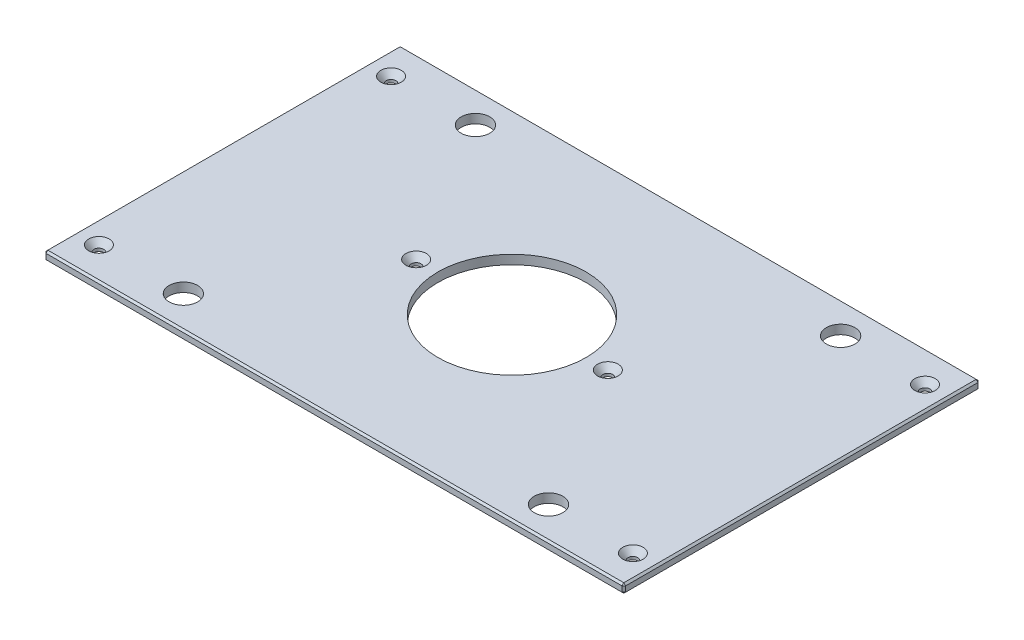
ISO-10303-21;
HEADER;
FILE_DESCRIPTION(('STEP AP214'),'2;1');
FILE_NAME('part.step','',(''),(''),'','','');
FILE_SCHEMA(('AUTOMOTIVE_DESIGN { 1 0 10303 214 1 1 1 1 }'));
ENDSEC;
DATA;
#1=APPLICATION_CONTEXT('core data for automotive mechanical design processes');
#2=APPLICATION_PROTOCOL_DEFINITION('international standard','automotive_design',2000,#1);
#3=PRODUCT_CONTEXT('',#1,'mechanical');
#4=PRODUCT('Part','Part','',(#3));
#5=PRODUCT_RELATED_PRODUCT_CATEGORY('part','',(#4));
#6=PRODUCT_DEFINITION_FORMATION('','',#4);
#7=PRODUCT_DEFINITION_CONTEXT('part definition',#1,'design');
#8=PRODUCT_DEFINITION('design','',#6,#7);
#9=PRODUCT_DEFINITION_SHAPE('','',#8);
#10=(LENGTH_UNIT() NAMED_UNIT(*) SI_UNIT(.MILLI.,.METRE.));
#11=(NAMED_UNIT(*) PLANE_ANGLE_UNIT() SI_UNIT($,.RADIAN.));
#12=(NAMED_UNIT(*) SI_UNIT($,.STERADIAN.) SOLID_ANGLE_UNIT());
#13=UNCERTAINTY_MEASURE_WITH_UNIT(LENGTH_MEASURE(1.E-05),#10,'distance_accuracy_value','');
#14=(GEOMETRIC_REPRESENTATION_CONTEXT(3) GLOBAL_UNCERTAINTY_ASSIGNED_CONTEXT((#13)) GLOBAL_UNIT_ASSIGNED_CONTEXT((#10,
#11,#12)) REPRESENTATION_CONTEXT('',''));
#15=CARTESIAN_POINT('',(0.,0.,0.));
#16=DIRECTION('',(0.,0.,1.));
#17=DIRECTION('',(1.,0.,0.));
#18=AXIS2_PLACEMENT_3D('',#15,#16,#17);
#19=CARTESIAN_POINT('',(-201.6125,6.35,-123.825));
#20=DIRECTION('',(1.,0.,0.));
#21=DIRECTION('',(0.,0.,-1.));
#22=AXIS2_PLACEMENT_3D('',#19,#20,#21);
#23=PLANE('',#22);
#24=DIRECTION('',(0.,0.,-1.));
#25=VECTOR('',#24,1.);
#26=CARTESIAN_POINT('',(-201.6125,5.08000000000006,-123.825));
#27=LINE('',#26,#25);
#28=CARTESIAN_POINT('',(-201.6125,5.08000000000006,122.555));
#29=VERTEX_POINT('',#28);
#30=CARTESIAN_POINT('',(-201.6125,5.08000000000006,-122.555));
#31=VERTEX_POINT('',#30);
#32=EDGE_CURVE('E136',#29,#31,#27,.T.);
#33=ORIENTED_EDGE('',*,*,#32,.T.);
#34=DIRECTION('',(0.,-1.,0.));
#35=VECTOR('',#34,1.);
#36=CARTESIAN_POINT('',(-201.6125,6.35,-122.555));
#37=LINE('',#36,#35);
#38=CARTESIAN_POINT('',(-201.6125,1.26999999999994,-122.555));
#39=VERTEX_POINT('',#38);
#40=EDGE_CURVE('E132',#31,#39,#37,.T.);
#41=ORIENTED_EDGE('',*,*,#40,.T.);
#42=DIRECTION('',(0.,0.,1.));
#43=VECTOR('',#42,1.);
#44=CARTESIAN_POINT('',(-201.6125,1.26999999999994,-123.825));
#45=LINE('',#44,#43);
#46=CARTESIAN_POINT('',(-201.6125,1.26999999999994,122.555));
#47=VERTEX_POINT('',#46);
#48=EDGE_CURVE('E127',#39,#47,#45,.T.);
#49=ORIENTED_EDGE('',*,*,#48,.T.);
#50=DIRECTION('',(0.,1.,0.));
#51=VECTOR('',#50,1.);
#52=CARTESIAN_POINT('',(-201.6125,6.35,122.555));
#53=LINE('',#52,#51);
#54=EDGE_CURVE('E129',#47,#29,#53,.T.);
#55=ORIENTED_EDGE('',*,*,#54,.T.);
#56=EDGE_LOOP('',(#33,#41,#49,#55));
#57=FACE_BOUND('',#56,.T.);
#58=ADVANCED_FACE('F36',(#57),#23,.F.);
#59=CARTESIAN_POINT('',(-201.6125,6.35,123.825));
#60=DIRECTION('',(0.,0.,-1.));
#61=DIRECTION('',(-1.,0.,0.));
#62=AXIS2_PLACEMENT_3D('',#59,#60,#61);
#63=PLANE('',#62);
#64=DIRECTION('',(1.,0.,0.));
#65=VECTOR('',#64,1.);
#66=CARTESIAN_POINT('',(-201.6125,1.26999999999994,123.825));
#67=LINE('',#66,#65);
#68=CARTESIAN_POINT('',(-200.3425,1.26999999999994,123.825));
#69=VERTEX_POINT('',#68);
#70=CARTESIAN_POINT('',(200.3425,1.26999999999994,123.825));
#71=VERTEX_POINT('',#70);
#72=EDGE_CURVE('E59',#69,#71,#67,.T.);
#73=ORIENTED_EDGE('',*,*,#72,.T.);
#74=DIRECTION('',(0.,1.,0.));
#75=VECTOR('',#74,1.);
#76=CARTESIAN_POINT('',(200.3425,6.35,123.825));
#77=LINE('',#76,#75);
#78=CARTESIAN_POINT('',(200.3425,5.08000000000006,123.825));
#79=VERTEX_POINT('',#78);
#80=EDGE_CURVE('E11',#71,#79,#77,.T.);
#81=ORIENTED_EDGE('',*,*,#80,.T.);
#82=DIRECTION('',(-1.,0.,0.));
#83=VECTOR('',#82,1.);
#84=CARTESIAN_POINT('',(-201.6125,5.08000000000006,123.825));
#85=LINE('',#84,#83);
#86=CARTESIAN_POINT('',(-200.3425,5.08000000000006,123.825));
#87=VERTEX_POINT('',#86);
#88=EDGE_CURVE('E45',#79,#87,#85,.T.);
#89=ORIENTED_EDGE('',*,*,#88,.T.);
#90=DIRECTION('',(0.,-1.,0.));
#91=VECTOR('',#90,1.);
#92=CARTESIAN_POINT('',(-200.3425,6.35,123.825));
#93=LINE('',#92,#91);
#94=EDGE_CURVE('E280',#87,#69,#93,.T.);
#95=ORIENTED_EDGE('',*,*,#94,.T.);
#96=EDGE_LOOP('',(#73,#81,#89,#95));
#97=FACE_BOUND('',#96,.T.);
#98=ADVANCED_FACE('F349',(#97),#63,.F.);
#99=CARTESIAN_POINT('',(201.6125,6.35,-123.825));
#100=DIRECTION('',(-1.,0.,0.));
#101=DIRECTION('',(0.,0.,1.));
#102=AXIS2_PLACEMENT_3D('',#99,#100,#101);
#103=PLANE('',#102);
#104=DIRECTION('',(0.,0.,-1.));
#105=VECTOR('',#104,1.);
#106=CARTESIAN_POINT('',(201.6125,1.26999999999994,-123.825));
#107=LINE('',#106,#105);
#108=CARTESIAN_POINT('',(201.6125,1.26999999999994,122.555));
#109=VERTEX_POINT('',#108);
#110=CARTESIAN_POINT('',(201.6125,1.26999999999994,-122.555));
#111=VERTEX_POINT('',#110);
#112=EDGE_CURVE('E275',#109,#111,#107,.T.);
#113=ORIENTED_EDGE('',*,*,#112,.T.);
#114=DIRECTION('',(0.,1.,0.));
#115=VECTOR('',#114,1.);
#116=CARTESIAN_POINT('',(201.6125,6.35,-122.555));
#117=LINE('',#116,#115);
#118=CARTESIAN_POINT('',(201.6125,5.08000000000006,-122.555));
#119=VERTEX_POINT('',#118);
#120=EDGE_CURVE('E277',#111,#119,#117,.T.);
#121=ORIENTED_EDGE('',*,*,#120,.T.);
#122=DIRECTION('',(0.,0.,1.));
#123=VECTOR('',#122,1.);
#124=CARTESIAN_POINT('',(201.6125,5.08000000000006,123.825));
#125=LINE('',#124,#123);
#126=CARTESIAN_POINT('',(201.6125,5.08000000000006,122.555));
#127=VERTEX_POINT('',#126);
#128=EDGE_CURVE('E273',#119,#127,#125,.T.);
#129=ORIENTED_EDGE('',*,*,#128,.T.);
#130=DIRECTION('',(0.,-1.,0.));
#131=VECTOR('',#130,1.);
#132=CARTESIAN_POINT('',(201.6125,6.35,122.555));
#133=LINE('',#132,#131);
#134=EDGE_CURVE('E271',#127,#109,#133,.T.);
#135=ORIENTED_EDGE('',*,*,#134,.T.);
#136=EDGE_LOOP('',(#113,#121,#129,#135));
#137=FACE_BOUND('',#136,.T.);
#138=ADVANCED_FACE('F336',(#137),#103,.F.);
#139=CARTESIAN_POINT('',(-201.6125,6.35,-123.825));
#140=DIRECTION('',(0.,0.,1.));
#141=DIRECTION('',(1.,0.,0.));
#142=AXIS2_PLACEMENT_3D('',#139,#140,#141);
#143=PLANE('',#142);
#144=DIRECTION('',(-1.,0.,0.));
#145=VECTOR('',#144,1.);
#146=CARTESIAN_POINT('',(-201.6125,1.26999999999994,-123.825));
#147=LINE('',#146,#145);
#148=CARTESIAN_POINT('',(200.3425,1.26999999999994,-123.825));
#149=VERTEX_POINT('',#148);
#150=CARTESIAN_POINT('',(-200.3425,1.26999999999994,-123.825));
#151=VERTEX_POINT('',#150);
#152=EDGE_CURVE('E247',#149,#151,#147,.T.);
#153=ORIENTED_EDGE('',*,*,#152,.T.);
#154=DIRECTION('',(0.,1.,0.));
#155=VECTOR('',#154,1.);
#156=CARTESIAN_POINT('',(-200.3425,6.35,-123.825));
#157=LINE('',#156,#155);
#158=CARTESIAN_POINT('',(-200.3425,5.08000000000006,-123.825));
#159=VERTEX_POINT('',#158);
#160=EDGE_CURVE('E251',#151,#159,#157,.T.);
#161=ORIENTED_EDGE('',*,*,#160,.T.);
#162=DIRECTION('',(1.,0.,0.));
#163=VECTOR('',#162,1.);
#164=CARTESIAN_POINT('',(201.6125,5.08000000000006,-123.825));
#165=LINE('',#164,#163);
#166=CARTESIAN_POINT('',(200.3425,5.08000000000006,-123.825));
#167=VERTEX_POINT('',#166);
#168=EDGE_CURVE('E249',#159,#167,#165,.T.);
#169=ORIENTED_EDGE('',*,*,#168,.T.);
#170=DIRECTION('',(0.,-1.,0.));
#171=VECTOR('',#170,1.);
#172=CARTESIAN_POINT('',(200.3425,6.35,-123.825));
#173=LINE('',#172,#171);
#174=EDGE_CURVE('E245',#167,#149,#173,.T.);
#175=ORIENTED_EDGE('',*,*,#174,.T.);
#176=EDGE_LOOP('',(#153,#161,#169,#175));
#177=FACE_BOUND('',#176,.T.);
#178=ADVANCED_FACE('F310',(#177),#143,.F.);
#179=CARTESIAN_POINT('',(0.,6.35,0.));
#180=DIRECTION('',(0.,1.,0.));
#181=DIRECTION('',(0.,0.,1.));
#182=AXIS2_PLACEMENT_3D('',#179,#180,#181);
#183=PLANE('',#182);
#184=CARTESIAN_POINT('',(185.7375,6.35,-101.6));
#185=DIRECTION('',(0.,1.,0.));
#186=DIRECTION('',(0.,0.,1.));
#187=AXIS2_PLACEMENT_3D('',#184,#185,#186);
#188=CIRCLE('',#187,7.13739999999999);
#189=CARTESIAN_POINT('',(185.7375,6.35,-94.4626));
#190=VERTEX_POINT('',#189);
#191=EDGE_CURVE('E753',#190,#190,#188,.T.);
#192=ORIENTED_EDGE('',*,*,#191,.F.);
#193=EDGE_LOOP('',(#192));
#194=FACE_BOUND('',#193,.T.);
#195=CARTESIAN_POINT('',(185.7375,6.35,101.6));
#196=DIRECTION('',(0.,1.,0.));
#197=DIRECTION('',(0.,0.,1.));
#198=AXIS2_PLACEMENT_3D('',#195,#196,#197);
#199=CIRCLE('',#198,7.13739999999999);
#200=CARTESIAN_POINT('',(185.7375,6.35,108.7374));
#201=VERTEX_POINT('',#200);
#202=EDGE_CURVE('E757',#201,#201,#199,.T.);
#203=ORIENTED_EDGE('',*,*,#202,.F.);
#204=EDGE_LOOP('',(#203));
#205=FACE_BOUND('',#204,.T.);
#206=CARTESIAN_POINT('',(-185.7375,6.35,101.6));
#207=DIRECTION('',(0.,1.,0.));
#208=DIRECTION('',(0.,0.,1.));
#209=AXIS2_PLACEMENT_3D('',#206,#207,#208);
#210=CIRCLE('',#209,7.13739999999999);
#211=CARTESIAN_POINT('',(-185.7375,6.35,108.7374));
#212=VERTEX_POINT('',#211);
#213=EDGE_CURVE('E761',#212,#212,#210,.T.);
#214=ORIENTED_EDGE('',*,*,#213,.F.);
#215=EDGE_LOOP('',(#214));
#216=FACE_BOUND('',#215,.T.);
#217=CARTESIAN_POINT('',(-66.675,6.35,0.));
#218=DIRECTION('',(0.,1.,0.));
#219=DIRECTION('',(0.,0.,1.));
#220=AXIS2_PLACEMENT_3D('',#217,#218,#219);
#221=CIRCLE('',#220,7.1374);
#222=CARTESIAN_POINT('',(-66.675,6.35,7.1374));
#223=VERTEX_POINT('',#222);
#224=EDGE_CURVE('E765',#223,#223,#221,.T.);
#225=ORIENTED_EDGE('',*,*,#224,.F.);
#226=EDGE_LOOP('',(#225));
#227=FACE_BOUND('',#226,.T.);
#228=CARTESIAN_POINT('',(66.675,6.35,0.));
#229=DIRECTION('',(0.,1.,0.));
#230=DIRECTION('',(0.,0.,1.));
#231=AXIS2_PLACEMENT_3D('',#228,#229,#230);
#232=CIRCLE('',#231,7.1374);
#233=CARTESIAN_POINT('',(66.675,6.35,7.1374));
#234=VERTEX_POINT('',#233);
#235=EDGE_CURVE('E769',#234,#234,#232,.T.);
#236=ORIENTED_EDGE('',*,*,#235,.F.);
#237=EDGE_LOOP('',(#236));
#238=FACE_BOUND('',#237,.T.);
#239=CARTESIAN_POINT('',(-185.7375,6.35,-101.6));
#240=DIRECTION('',(0.,1.,0.));
#241=DIRECTION('',(0.,0.,1.));
#242=AXIS2_PLACEMENT_3D('',#239,#240,#241);
#243=CIRCLE('',#242,7.13739999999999);
#244=CARTESIAN_POINT('',(-185.7375,6.35,-94.4626));
#245=VERTEX_POINT('',#244);
#246=EDGE_CURVE('E772',#245,#245,#243,.T.);
#247=ORIENTED_EDGE('',*,*,#246,.F.);
#248=EDGE_LOOP('',(#247));
#249=FACE_BOUND('',#248,.T.);
#250=DIRECTION('',(0.,0.,-1.));
#251=VECTOR('',#250,1.);
#252=CARTESIAN_POINT('',(200.3425,6.35,-123.825));
#253=LINE('',#252,#251);
#254=CARTESIAN_POINT('',(200.3425,6.35,122.555));
#255=VERTEX_POINT('',#254);
#256=CARTESIAN_POINT('',(200.3425,6.35,-122.555));
#257=VERTEX_POINT('',#256);
#258=EDGE_CURVE('E258',#255,#257,#253,.T.);
#259=ORIENTED_EDGE('',*,*,#258,.T.);
#260=DIRECTION('',(-1.,0.,0.));
#261=VECTOR('',#260,1.);
#262=CARTESIAN_POINT('',(-201.6125,6.35,-122.555));
#263=LINE('',#262,#261);
#264=CARTESIAN_POINT('',(-200.3425,6.35,-122.555));
#265=VERTEX_POINT('',#264);
#266=EDGE_CURVE('E260',#257,#265,#263,.T.);
#267=ORIENTED_EDGE('',*,*,#266,.T.);
#268=DIRECTION('',(0.,0.,1.));
#269=VECTOR('',#268,1.);
#270=CARTESIAN_POINT('',(-200.3425,6.35,123.825));
#271=LINE('',#270,#269);
#272=CARTESIAN_POINT('',(-200.3425,6.35,122.555));
#273=VERTEX_POINT('',#272);
#274=EDGE_CURVE('E256',#265,#273,#271,.T.);
#275=ORIENTED_EDGE('',*,*,#274,.T.);
#276=DIRECTION('',(1.,0.,0.));
#277=VECTOR('',#276,1.);
#278=CARTESIAN_POINT('',(201.6125,6.35,122.555));
#279=LINE('',#278,#277);
#280=EDGE_CURVE('E254',#273,#255,#279,.T.);
#281=ORIENTED_EDGE('',*,*,#280,.T.);
#282=EDGE_LOOP('',(#259,#267,#275,#281));
#283=FACE_BOUND('',#282,.T.);
#284=CARTESIAN_POINT('',(127.,6.35,-101.6));
#285=DIRECTION('',(0.,1.,0.));
#286=DIRECTION('',(0.,0.,1.));
#287=AXIS2_PLACEMENT_3D('',#284,#285,#286);
#288=CIRCLE('',#287,9.921875);
#289=CARTESIAN_POINT('',(127.,6.35,-91.678125));
#290=VERTEX_POINT('',#289);
#291=EDGE_CURVE('E205',#290,#290,#288,.T.);
#292=ORIENTED_EDGE('',*,*,#291,.F.);
#293=EDGE_LOOP('',(#292));
#294=FACE_BOUND('',#293,.T.);
#295=CARTESIAN_POINT('',(-127.,6.35,-101.6));
#296=DIRECTION('',(0.,1.,0.));
#297=DIRECTION('',(0.,0.,1.));
#298=AXIS2_PLACEMENT_3D('',#295,#296,#297);
#299=CIRCLE('',#298,9.921875);
#300=CARTESIAN_POINT('',(-127.,6.35,-91.678125));
#301=VERTEX_POINT('',#300);
#302=EDGE_CURVE('E215',#301,#301,#299,.T.);
#303=ORIENTED_EDGE('',*,*,#302,.F.);
#304=EDGE_LOOP('',(#303));
#305=FACE_BOUND('',#304,.T.);
#306=CARTESIAN_POINT('',(127.,6.35,101.6));
#307=DIRECTION('',(0.,1.,0.));
#308=DIRECTION('',(0.,0.,1.));
#309=AXIS2_PLACEMENT_3D('',#306,#307,#308);
#310=CIRCLE('',#309,9.921875);
#311=CARTESIAN_POINT('',(127.,6.35,111.521875));
#312=VERTEX_POINT('',#311);
#313=EDGE_CURVE('E226',#312,#312,#310,.T.);
#314=ORIENTED_EDGE('',*,*,#313,.F.);
#315=EDGE_LOOP('',(#314));
#316=FACE_BOUND('',#315,.T.);
#317=CARTESIAN_POINT('',(-127.,6.35,101.6));
#318=DIRECTION('',(0.,1.,0.));
#319=DIRECTION('',(0.,0.,1.));
#320=AXIS2_PLACEMENT_3D('',#317,#318,#319);
#321=CIRCLE('',#320,9.921875);
#322=CARTESIAN_POINT('',(-127.,6.35,111.521875));
#323=VERTEX_POINT('',#322);
#324=EDGE_CURVE('E232',#323,#323,#321,.T.);
#325=ORIENTED_EDGE('',*,*,#324,.F.);
#326=EDGE_LOOP('',(#325));
#327=FACE_BOUND('',#326,.T.);
#328=CARTESIAN_POINT('',(0.,6.35,0.));
#329=DIRECTION('',(0.,1.,0.));
#330=DIRECTION('',(0.,0.,1.));
#331=AXIS2_PLACEMENT_3D('',#328,#329,#330);
#332=CIRCLE('',#331,51.562);
#333=CARTESIAN_POINT('',(0.,6.35,51.562));
#334=VERTEX_POINT('',#333);
#335=EDGE_CURVE('E238',#334,#334,#332,.T.);
#336=ORIENTED_EDGE('',*,*,#335,.F.);
#337=EDGE_LOOP('',(#336));
#338=FACE_BOUND('',#337,.T.);
#339=ADVANCED_FACE('F358',(#194,#205,#216,#227,#238,#249,#283,#294,#305,#316,#327,#338),#183,.T.);
#340=CARTESIAN_POINT('',(0.,0.,0.));
#341=DIRECTION('',(0.,1.,0.));
#342=DIRECTION('',(0.,0.,1.));
#343=AXIS2_PLACEMENT_3D('',#340,#341,#342);
#344=PLANE('',#343);
#345=CARTESIAN_POINT('',(185.7375,0.,-101.6));
#346=DIRECTION('',(0.,1.,0.));
#347=DIRECTION('',(0.,0.,1.));
#348=AXIS2_PLACEMENT_3D('',#345,#346,#347);
#349=CIRCLE('',#348,3.3782);
#350=CARTESIAN_POINT('',(185.7375,0.,-98.2218));
#351=VERTEX_POINT('',#350);
#352=EDGE_CURVE('E806',#351,#351,#349,.T.);
#353=ORIENTED_EDGE('',*,*,#352,.T.);
#354=EDGE_LOOP('',(#353));
#355=FACE_BOUND('',#354,.T.);
#356=CARTESIAN_POINT('',(185.7375,0.,101.6));
#357=DIRECTION('',(0.,1.,0.));
#358=DIRECTION('',(0.,0.,1.));
#359=AXIS2_PLACEMENT_3D('',#356,#357,#358);
#360=CIRCLE('',#359,3.3782);
#361=CARTESIAN_POINT('',(185.7375,0.,104.9782));
#362=VERTEX_POINT('',#361);
#363=EDGE_CURVE('E799',#362,#362,#360,.T.);
#364=ORIENTED_EDGE('',*,*,#363,.T.);
#365=EDGE_LOOP('',(#364));
#366=FACE_BOUND('',#365,.T.);
#367=CARTESIAN_POINT('',(-185.7375,0.,101.6));
#368=DIRECTION('',(0.,1.,0.));
#369=DIRECTION('',(0.,0.,1.));
#370=AXIS2_PLACEMENT_3D('',#367,#368,#369);
#371=CIRCLE('',#370,3.3782);
#372=CARTESIAN_POINT('',(-185.7375,0.,104.9782));
#373=VERTEX_POINT('',#372);
#374=EDGE_CURVE('E792',#373,#373,#371,.T.);
#375=ORIENTED_EDGE('',*,*,#374,.T.);
#376=EDGE_LOOP('',(#375));
#377=FACE_BOUND('',#376,.T.);
#378=CARTESIAN_POINT('',(-66.675,0.,0.));
#379=DIRECTION('',(0.,1.,0.));
#380=DIRECTION('',(0.,0.,1.));
#381=AXIS2_PLACEMENT_3D('',#378,#379,#380);
#382=CIRCLE('',#381,3.3782);
#383=CARTESIAN_POINT('',(-66.675,0.,3.3782));
#384=VERTEX_POINT('',#383);
#385=EDGE_CURVE('E785',#384,#384,#382,.T.);
#386=ORIENTED_EDGE('',*,*,#385,.T.);
#387=EDGE_LOOP('',(#386));
#388=FACE_BOUND('',#387,.T.);
#389=CARTESIAN_POINT('',(66.675,0.,0.));
#390=DIRECTION('',(0.,1.,0.));
#391=DIRECTION('',(0.,0.,1.));
#392=AXIS2_PLACEMENT_3D('',#389,#390,#391);
#393=CIRCLE('',#392,3.3782);
#394=CARTESIAN_POINT('',(66.675,0.,3.3782));
#395=VERTEX_POINT('',#394);
#396=EDGE_CURVE('E775',#395,#395,#393,.T.);
#397=ORIENTED_EDGE('',*,*,#396,.T.);
#398=EDGE_LOOP('',(#397));
#399=FACE_BOUND('',#398,.T.);
#400=CARTESIAN_POINT('',(-185.7375,0.,-101.6));
#401=DIRECTION('',(0.,1.,0.));
#402=DIRECTION('',(0.,0.,1.));
#403=AXIS2_PLACEMENT_3D('',#400,#401,#402);
#404=CIRCLE('',#403,3.3782);
#405=CARTESIAN_POINT('',(-185.7375,0.,-98.2218));
#406=VERTEX_POINT('',#405);
#407=EDGE_CURVE('E218',#406,#406,#404,.T.);
#408=ORIENTED_EDGE('',*,*,#407,.T.);
#409=EDGE_LOOP('',(#408));
#410=FACE_BOUND('',#409,.T.);
#411=DIRECTION('',(0.,0.,-1.));
#412=VECTOR('',#411,1.);
#413=CARTESIAN_POINT('',(-200.3425,0.,0.));
#414=LINE('',#413,#412);
#415=CARTESIAN_POINT('',(-200.3425,0.,122.555));
#416=VERTEX_POINT('',#415);
#417=CARTESIAN_POINT('',(-200.3425,0.,-122.555));
#418=VERTEX_POINT('',#417);
#419=EDGE_CURVE('E159',#416,#418,#414,.T.);
#420=ORIENTED_EDGE('',*,*,#419,.T.);
#421=DIRECTION('',(1.,0.,0.));
#422=VECTOR('',#421,1.);
#423=CARTESIAN_POINT('',(0.,0.,-122.555));
#424=LINE('',#423,#422);
#425=CARTESIAN_POINT('',(200.3425,0.,-122.555));
#426=VERTEX_POINT('',#425);
#427=EDGE_CURVE('E268',#418,#426,#424,.T.);
#428=ORIENTED_EDGE('',*,*,#427,.T.);
#429=DIRECTION('',(0.,0.,1.));
#430=VECTOR('',#429,1.);
#431=CARTESIAN_POINT('',(200.3425,0.,0.));
#432=LINE('',#431,#430);
#433=CARTESIAN_POINT('',(200.3425,0.,122.555));
#434=VERTEX_POINT('',#433);
#435=EDGE_CURVE('E266',#426,#434,#432,.T.);
#436=ORIENTED_EDGE('',*,*,#435,.T.);
#437=DIRECTION('',(-1.,0.,0.));
#438=VECTOR('',#437,1.);
#439=CARTESIAN_POINT('',(0.,0.,122.555));
#440=LINE('',#439,#438);
#441=EDGE_CURVE('E263',#434,#416,#440,.T.);
#442=ORIENTED_EDGE('',*,*,#441,.T.);
#443=EDGE_LOOP('',(#420,#428,#436,#442));
#444=FACE_BOUND('',#443,.T.);
#445=CARTESIAN_POINT('',(127.,0.,-101.6));
#446=DIRECTION('',(0.,1.,0.));
#447=DIRECTION('',(0.,0.,1.));
#448=AXIS2_PLACEMENT_3D('',#445,#446,#447);
#449=CIRCLE('',#448,9.921875);
#450=CARTESIAN_POINT('',(127.,0.,-91.678125));
#451=VERTEX_POINT('',#450);
#452=EDGE_CURVE('E210',#451,#451,#449,.T.);
#453=ORIENTED_EDGE('',*,*,#452,.T.);
#454=EDGE_LOOP('',(#453));
#455=FACE_BOUND('',#454,.T.);
#456=CARTESIAN_POINT('',(-127.,0.,-101.6));
#457=DIRECTION('',(0.,1.,0.));
#458=DIRECTION('',(0.,0.,1.));
#459=AXIS2_PLACEMENT_3D('',#456,#457,#458);
#460=CIRCLE('',#459,9.921875);
#461=CARTESIAN_POINT('',(-127.,0.,-91.678125));
#462=VERTEX_POINT('',#461);
#463=EDGE_CURVE('E223',#462,#462,#460,.T.);
#464=ORIENTED_EDGE('',*,*,#463,.T.);
#465=EDGE_LOOP('',(#464));
#466=FACE_BOUND('',#465,.T.);
#467=CARTESIAN_POINT('',(127.,0.,101.6));
#468=DIRECTION('',(0.,1.,0.));
#469=DIRECTION('',(0.,0.,1.));
#470=AXIS2_PLACEMENT_3D('',#467,#468,#469);
#471=CIRCLE('',#470,9.921875);
#472=CARTESIAN_POINT('',(127.,0.,111.521875));
#473=VERTEX_POINT('',#472);
#474=EDGE_CURVE('E229',#473,#473,#471,.T.);
#475=ORIENTED_EDGE('',*,*,#474,.T.);
#476=EDGE_LOOP('',(#475));
#477=FACE_BOUND('',#476,.T.);
#478=CARTESIAN_POINT('',(-127.,0.,101.6));
#479=DIRECTION('',(0.,1.,0.));
#480=DIRECTION('',(0.,0.,1.));
#481=AXIS2_PLACEMENT_3D('',#478,#479,#480);
#482=CIRCLE('',#481,9.921875);
#483=CARTESIAN_POINT('',(-127.,0.,111.521875));
#484=VERTEX_POINT('',#483);
#485=EDGE_CURVE('E235',#484,#484,#482,.T.);
#486=ORIENTED_EDGE('',*,*,#485,.T.);
#487=EDGE_LOOP('',(#486));
#488=FACE_BOUND('',#487,.T.);
#489=CARTESIAN_POINT('',(0.,0.,0.));
#490=DIRECTION('',(0.,1.,0.));
#491=DIRECTION('',(0.,0.,1.));
#492=AXIS2_PLACEMENT_3D('',#489,#490,#491);
#493=CIRCLE('',#492,51.562);
#494=CARTESIAN_POINT('',(0.,0.,51.562));
#495=VERTEX_POINT('',#494);
#496=EDGE_CURVE('E148',#495,#495,#493,.T.);
#497=ORIENTED_EDGE('',*,*,#496,.T.);
#498=EDGE_LOOP('',(#497));
#499=FACE_BOUND('',#498,.T.);
#500=ADVANCED_FACE('F323',(#355,#366,#377,#388,#399,#410,#444,#455,#466,#477,#488,#499),#344,.F.);
#501=CARTESIAN_POINT('',(0.,0.,0.));
#502=DIRECTION('',(0.,1.,0.));
#503=DIRECTION('',(0.,0.,1.));
#504=AXIS2_PLACEMENT_3D('',#501,#502,#503);
#505=CYLINDRICAL_SURFACE('',#504,51.562);
#506=ORIENTED_EDGE('',*,*,#496,.F.);
#507=EDGE_LOOP('',(#506));
#508=FACE_BOUND('',#507,.T.);
#509=ORIENTED_EDGE('',*,*,#335,.T.);
#510=EDGE_LOOP('',(#509));
#511=FACE_BOUND('',#510,.T.);
#512=ADVANCED_FACE('F692',(#508,#511),#505,.F.);
#513=CARTESIAN_POINT('',(-127.,6.35,101.6));
#514=DIRECTION('',(0.,1.,0.));
#515=DIRECTION('',(0.,0.,1.));
#516=AXIS2_PLACEMENT_3D('',#513,#514,#515);
#517=CYLINDRICAL_SURFACE('',#516,9.921875);
#518=ORIENTED_EDGE('',*,*,#485,.F.);
#519=EDGE_LOOP('',(#518));
#520=FACE_BOUND('',#519,.T.);
#521=ORIENTED_EDGE('',*,*,#324,.T.);
#522=EDGE_LOOP('',(#521));
#523=FACE_BOUND('',#522,.T.);
#524=ADVANCED_FACE('F683',(#520,#523),#517,.F.);
#525=CARTESIAN_POINT('',(127.,6.35,101.6));
#526=DIRECTION('',(0.,1.,0.));
#527=DIRECTION('',(0.,0.,1.));
#528=AXIS2_PLACEMENT_3D('',#525,#526,#527);
#529=CYLINDRICAL_SURFACE('',#528,9.921875);
#530=ORIENTED_EDGE('',*,*,#474,.F.);
#531=EDGE_LOOP('',(#530));
#532=FACE_BOUND('',#531,.T.);
#533=ORIENTED_EDGE('',*,*,#313,.T.);
#534=EDGE_LOOP('',(#533));
#535=FACE_BOUND('',#534,.T.);
#536=ADVANCED_FACE('F674',(#532,#535),#529,.F.);
#537=CARTESIAN_POINT('',(-127.,6.35,-101.6));
#538=DIRECTION('',(0.,1.,0.));
#539=DIRECTION('',(0.,0.,1.));
#540=AXIS2_PLACEMENT_3D('',#537,#538,#539);
#541=CYLINDRICAL_SURFACE('',#540,9.921875);
#542=ORIENTED_EDGE('',*,*,#463,.F.);
#543=EDGE_LOOP('',(#542));
#544=FACE_BOUND('',#543,.T.);
#545=ORIENTED_EDGE('',*,*,#302,.T.);
#546=EDGE_LOOP('',(#545));
#547=FACE_BOUND('',#546,.T.);
#548=ADVANCED_FACE('F664',(#544,#547),#541,.F.);
#549=CARTESIAN_POINT('',(127.,6.35,-101.6));
#550=DIRECTION('',(0.,1.,0.));
#551=DIRECTION('',(0.,0.,1.));
#552=AXIS2_PLACEMENT_3D('',#549,#550,#551);
#553=CYLINDRICAL_SURFACE('',#552,9.921875);
#554=ORIENTED_EDGE('',*,*,#452,.F.);
#555=EDGE_LOOP('',(#554));
#556=FACE_BOUND('',#555,.T.);
#557=ORIENTED_EDGE('',*,*,#291,.T.);
#558=EDGE_LOOP('',(#557));
#559=FACE_BOUND('',#558,.T.);
#560=ADVANCED_FACE('F367',(#556,#559),#553,.F.);
#561=CARTESIAN_POINT('',(201.6125,6.35,122.555));
#562=DIRECTION('',(-0.707106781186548,0.,-0.707106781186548));
#563=DIRECTION('',(0.,-1.,0.));
#564=AXIS2_PLACEMENT_3D('',#561,#562,#563);
#565=PLANE('',#564);
#566=DIRECTION('',(-0.707106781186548,0.,0.707106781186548));
#567=VECTOR('',#566,1.);
#568=CARTESIAN_POINT('',(201.6125,5.08000000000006,122.555));
#569=LINE('',#568,#567);
#570=EDGE_CURVE('E40',#79,#127,#569,.F.);
#571=ORIENTED_EDGE('',*,*,#570,.F.);
#572=ORIENTED_EDGE('',*,*,#80,.F.);
#573=DIRECTION('',(0.707106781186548,0.,-0.707106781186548));
#574=VECTOR('',#573,1.);
#575=CARTESIAN_POINT('',(200.9775,1.26999999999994,123.19));
#576=LINE('',#575,#574);
#577=EDGE_CURVE('E198',#109,#71,#576,.F.);
#578=ORIENTED_EDGE('',*,*,#577,.F.);
#579=ORIENTED_EDGE('',*,*,#134,.F.);
#580=EDGE_LOOP('',(#571,#572,#578,#579));
#581=FACE_BOUND('',#580,.T.);
#582=ADVANCED_FACE('F38',(#581),#565,.F.);
#583=CARTESIAN_POINT('',(201.6125,5.08000000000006,122.555));
#584=DIRECTION('',(0.577350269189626,0.577350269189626,0.577350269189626));
#585=DIRECTION('',(0.707106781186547,0.,-0.707106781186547));
#586=AXIS2_PLACEMENT_3D('',#583,#584,#585);
#587=PLANE('',#586);
#588=DIRECTION('',(0.,-0.707106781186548,0.707106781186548));
#589=VECTOR('',#588,1.);
#590=CARTESIAN_POINT('',(200.3425,5.71500000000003,123.19));
#591=LINE('',#590,#589);
#592=EDGE_CURVE('E194',#79,#255,#591,.F.);
#593=ORIENTED_EDGE('',*,*,#592,.F.);
#594=ORIENTED_EDGE('',*,*,#570,.T.);
#595=DIRECTION('',(-0.707106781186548,0.707106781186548,0.));
#596=VECTOR('',#595,1.);
#597=CARTESIAN_POINT('',(201.6125,5.08000000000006,122.555));
#598=LINE('',#597,#596);
#599=EDGE_CURVE('E196',#255,#127,#598,.F.);
#600=ORIENTED_EDGE('',*,*,#599,.F.);
#601=EDGE_LOOP('',(#593,#594,#600));
#602=FACE_BOUND('',#601,.T.);
#603=ADVANCED_FACE('F360',(#602),#587,.T.);
#604=CARTESIAN_POINT('',(200.3425,0.,122.555));
#605=DIRECTION('',(0.577350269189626,-0.577350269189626,0.577350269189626));
#606=DIRECTION('',(0.707106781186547,0.,-0.707106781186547));
#607=AXIS2_PLACEMENT_3D('',#604,#605,#606);
#608=PLANE('',#607);
#609=DIRECTION('',(-0.707106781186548,-0.707106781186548,0.));
#610=VECTOR('',#609,1.);
#611=CARTESIAN_POINT('',(200.3425,0.,122.555));
#612=LINE('',#611,#610);
#613=EDGE_CURVE('E188',#109,#434,#612,.T.);
#614=ORIENTED_EDGE('',*,*,#613,.F.);
#615=ORIENTED_EDGE('',*,*,#577,.T.);
#616=DIRECTION('',(0.,0.707106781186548,0.707106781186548));
#617=VECTOR('',#616,1.);
#618=CARTESIAN_POINT('',(200.3425,0.,122.555));
#619=LINE('',#618,#617);
#620=EDGE_CURVE('E191',#434,#71,#619,.T.);
#621=ORIENTED_EDGE('',*,*,#620,.F.);
#622=EDGE_LOOP('',(#614,#615,#621));
#623=FACE_BOUND('',#622,.T.);
#624=ADVANCED_FACE('F329',(#623),#608,.T.);
#625=CARTESIAN_POINT('',(200.3425,6.35,0.));
#626=DIRECTION('',(0.707106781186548,0.707106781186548,0.));
#627=DIRECTION('',(0.,0.,1.));
#628=AXIS2_PLACEMENT_3D('',#625,#626,#627);
#629=PLANE('',#628);
#630=ORIENTED_EDGE('',*,*,#599,.T.);
#631=ORIENTED_EDGE('',*,*,#128,.F.);
#632=DIRECTION('',(0.707106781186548,-0.707106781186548,0.));
#633=VECTOR('',#632,1.);
#634=CARTESIAN_POINT('',(200.9775,5.71500000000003,-122.555));
#635=LINE('',#634,#633);
#636=EDGE_CURVE('E183',#257,#119,#635,.T.);
#637=ORIENTED_EDGE('',*,*,#636,.F.);
#638=ORIENTED_EDGE('',*,*,#258,.F.);
#639=EDGE_LOOP('',(#630,#631,#637,#638));
#640=FACE_BOUND('',#639,.T.);
#641=ADVANCED_FACE('F346',(#640),#629,.T.);
#642=CARTESIAN_POINT('',(0.,6.35,122.555));
#643=DIRECTION('',(0.,0.707106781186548,0.707106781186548));
#644=DIRECTION('',(-1.,0.,0.));
#645=AXIS2_PLACEMENT_3D('',#642,#643,#644);
#646=PLANE('',#645);
#647=ORIENTED_EDGE('',*,*,#592,.T.);
#648=ORIENTED_EDGE('',*,*,#280,.F.);
#649=DIRECTION('',(0.,0.707106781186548,-0.707106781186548));
#650=VECTOR('',#649,1.);
#651=CARTESIAN_POINT('',(-200.3425,6.35,122.555));
#652=LINE('',#651,#650);
#653=EDGE_CURVE('E180',#87,#273,#652,.T.);
#654=ORIENTED_EDGE('',*,*,#653,.F.);
#655=ORIENTED_EDGE('',*,*,#88,.F.);
#656=EDGE_LOOP('',(#647,#648,#654,#655));
#657=FACE_BOUND('',#656,.T.);
#658=ADVANCED_FACE('F351',(#657),#646,.T.);
#659=CARTESIAN_POINT('',(-200.3425,6.35,123.825));
#660=DIRECTION('',(0.707106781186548,0.,-0.707106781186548));
#661=DIRECTION('',(0.,-1.,0.));
#662=AXIS2_PLACEMENT_3D('',#659,#660,#661);
#663=PLANE('',#662);
#664=DIRECTION('',(0.707106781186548,0.,0.707106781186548));
#665=VECTOR('',#664,1.);
#666=CARTESIAN_POINT('',(-201.6125,1.26999999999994,122.555));
#667=LINE('',#666,#665);
#668=EDGE_CURVE('E143',#69,#47,#667,.F.);
#669=ORIENTED_EDGE('',*,*,#668,.F.);
#670=ORIENTED_EDGE('',*,*,#94,.F.);
#671=DIRECTION('',(-0.707106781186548,0.,-0.707106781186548));
#672=VECTOR('',#671,1.);
#673=CARTESIAN_POINT('',(-200.9775,5.08000000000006,123.19));
#674=LINE('',#673,#672);
#675=EDGE_CURVE('E146',#29,#87,#674,.F.);
#676=ORIENTED_EDGE('',*,*,#675,.F.);
#677=ORIENTED_EDGE('',*,*,#54,.F.);
#678=EDGE_LOOP('',(#669,#670,#676,#677));
#679=FACE_BOUND('',#678,.T.);
#680=ADVANCED_FACE('F141',(#679),#663,.F.);
#681=CARTESIAN_POINT('',(-201.6125,1.26999999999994,123.825));
#682=DIRECTION('',(0.,0.707106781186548,-0.707106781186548));
#683=DIRECTION('',(1.,0.,0.));
#684=AXIS2_PLACEMENT_3D('',#681,#682,#683);
#685=PLANE('',#684);
#686=ORIENTED_EDGE('',*,*,#620,.T.);
#687=ORIENTED_EDGE('',*,*,#72,.F.);
#688=DIRECTION('',(0.,-0.707106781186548,-0.707106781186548));
#689=VECTOR('',#688,1.);
#690=CARTESIAN_POINT('',(-200.3425,0.634999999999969,123.19));
#691=LINE('',#690,#689);
#692=EDGE_CURVE('E156',#416,#69,#691,.F.);
#693=ORIENTED_EDGE('',*,*,#692,.F.);
#694=ORIENTED_EDGE('',*,*,#441,.F.);
#695=EDGE_LOOP('',(#686,#687,#693,#694));
#696=FACE_BOUND('',#695,.T.);
#697=ADVANCED_FACE('F328',(#696),#685,.F.);
#698=CARTESIAN_POINT('',(201.6125,1.26999999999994,-123.825));
#699=DIRECTION('',(-0.707106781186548,0.707106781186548,0.));
#700=DIRECTION('',(0.,0.,-1.));
#701=AXIS2_PLACEMENT_3D('',#698,#699,#700);
#702=PLANE('',#701);
#703=ORIENTED_EDGE('',*,*,#613,.T.);
#704=ORIENTED_EDGE('',*,*,#435,.F.);
#705=DIRECTION('',(0.707106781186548,0.707106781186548,0.));
#706=VECTOR('',#705,1.);
#707=CARTESIAN_POINT('',(200.3425,0.,-122.555));
#708=LINE('',#707,#706);
#709=EDGE_CURVE('E175',#111,#426,#708,.F.);
#710=ORIENTED_EDGE('',*,*,#709,.F.);
#711=ORIENTED_EDGE('',*,*,#112,.F.);
#712=EDGE_LOOP('',(#703,#704,#710,#711));
#713=FACE_BOUND('',#712,.T.);
#714=ADVANCED_FACE('F333',(#713),#702,.F.);
#715=CARTESIAN_POINT('',(200.3425,6.35,-123.825));
#716=DIRECTION('',(-0.707106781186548,0.,0.707106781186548));
#717=DIRECTION('',(0.,-1.,0.));
#718=AXIS2_PLACEMENT_3D('',#715,#716,#717);
#719=PLANE('',#718);
#720=DIRECTION('',(0.707106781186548,0.,0.707106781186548));
#721=VECTOR('',#720,1.);
#722=CARTESIAN_POINT('',(200.3425,5.08000000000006,-123.825));
#723=LINE('',#722,#721);
#724=EDGE_CURVE('E185',#119,#167,#723,.F.);
#725=ORIENTED_EDGE('',*,*,#724,.F.);
#726=ORIENTED_EDGE('',*,*,#120,.F.);
#727=DIRECTION('',(-0.707106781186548,0.,-0.707106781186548));
#728=VECTOR('',#727,1.);
#729=CARTESIAN_POINT('',(200.9775,1.26999999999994,-123.19));
#730=LINE('',#729,#728);
#731=EDGE_CURVE('E172',#149,#111,#730,.F.);
#732=ORIENTED_EDGE('',*,*,#731,.F.);
#733=ORIENTED_EDGE('',*,*,#174,.F.);
#734=EDGE_LOOP('',(#725,#726,#732,#733));
#735=FACE_BOUND('',#734,.T.);
#736=ADVANCED_FACE('F341',(#735),#719,.F.);
#737=CARTESIAN_POINT('',(200.3425,5.08000000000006,-123.825));
#738=DIRECTION('',(0.577350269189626,0.577350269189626,-0.577350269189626));
#739=DIRECTION('',(-0.707106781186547,0.,-0.707106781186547));
#740=AXIS2_PLACEMENT_3D('',#737,#738,#739);
#741=PLANE('',#740);
#742=ORIENTED_EDGE('',*,*,#636,.T.);
#743=ORIENTED_EDGE('',*,*,#724,.T.);
#744=DIRECTION('',(0.,0.707106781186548,0.707106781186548));
#745=VECTOR('',#744,1.);
#746=CARTESIAN_POINT('',(200.3425,5.08000000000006,-123.825));
#747=LINE('',#746,#745);
#748=EDGE_CURVE('E164',#257,#167,#747,.F.);
#749=ORIENTED_EDGE('',*,*,#748,.F.);
#750=EDGE_LOOP('',(#742,#743,#749));
#751=FACE_BOUND('',#750,.T.);
#752=ADVANCED_FACE('F399',(#751),#741,.T.);
#753=CARTESIAN_POINT('',(-200.3425,6.35,122.555));
#754=DIRECTION('',(-0.577350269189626,0.577350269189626,0.577350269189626));
#755=DIRECTION('',(0.707106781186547,0.,0.707106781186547));
#756=AXIS2_PLACEMENT_3D('',#753,#754,#755);
#757=PLANE('',#756);
#758=ORIENTED_EDGE('',*,*,#675,.T.);
#759=ORIENTED_EDGE('',*,*,#653,.T.);
#760=DIRECTION('',(-0.707106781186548,-0.707106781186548,0.));
#761=VECTOR('',#760,1.);
#762=CARTESIAN_POINT('',(-200.3425,6.35,122.555));
#763=LINE('',#762,#761);
#764=EDGE_CURVE('E160',#29,#273,#763,.F.);
#765=ORIENTED_EDGE('',*,*,#764,.F.);
#766=EDGE_LOOP('',(#758,#759,#765));
#767=FACE_BOUND('',#766,.T.);
#768=ADVANCED_FACE('F353',(#767),#757,.T.);
#769=CARTESIAN_POINT('',(-201.6125,1.26999999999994,122.555));
#770=DIRECTION('',(-0.577350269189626,-0.577350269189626,0.577350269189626));
#771=DIRECTION('',(0.707106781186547,0.,0.707106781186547));
#772=AXIS2_PLACEMENT_3D('',#769,#770,#771);
#773=PLANE('',#772);
#774=ORIENTED_EDGE('',*,*,#692,.T.);
#775=ORIENTED_EDGE('',*,*,#668,.T.);
#776=DIRECTION('',(-0.707106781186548,0.707106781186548,0.));
#777=VECTOR('',#776,1.);
#778=CARTESIAN_POINT('',(-201.6125,1.26999999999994,122.555));
#779=LINE('',#778,#777);
#780=EDGE_CURVE('E153',#416,#47,#779,.T.);
#781=ORIENTED_EDGE('',*,*,#780,.F.);
#782=EDGE_LOOP('',(#774,#775,#781));
#783=FACE_BOUND('',#782,.T.);
#784=ADVANCED_FACE('F152',(#783),#773,.T.);
#785=CARTESIAN_POINT('',(200.3425,0.,-122.555));
#786=DIRECTION('',(0.577350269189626,-0.577350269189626,-0.577350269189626));
#787=DIRECTION('',(-0.707106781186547,0.,-0.707106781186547));
#788=AXIS2_PLACEMENT_3D('',#785,#786,#787);
#789=PLANE('',#788);
#790=ORIENTED_EDGE('',*,*,#731,.T.);
#791=ORIENTED_EDGE('',*,*,#709,.T.);
#792=DIRECTION('',(0.,-0.707106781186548,0.707106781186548));
#793=VECTOR('',#792,1.);
#794=CARTESIAN_POINT('',(200.3425,0.,-122.555));
#795=LINE('',#794,#793);
#796=EDGE_CURVE('E161',#149,#426,#795,.T.);
#797=ORIENTED_EDGE('',*,*,#796,.F.);
#798=EDGE_LOOP('',(#790,#791,#797));
#799=FACE_BOUND('',#798,.T.);
#800=ADVANCED_FACE('F391',(#799),#789,.T.);
#801=CARTESIAN_POINT('',(0.,6.35,-122.555));
#802=DIRECTION('',(0.,0.707106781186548,-0.707106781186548));
#803=DIRECTION('',(1.,0.,0.));
#804=AXIS2_PLACEMENT_3D('',#801,#802,#803);
#805=PLANE('',#804);
#806=ORIENTED_EDGE('',*,*,#748,.T.);
#807=ORIENTED_EDGE('',*,*,#168,.F.);
#808=DIRECTION('',(0.,-0.707106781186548,-0.707106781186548));
#809=VECTOR('',#808,1.);
#810=CARTESIAN_POINT('',(-200.3425,5.08000000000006,-123.825));
#811=LINE('',#810,#809);
#812=EDGE_CURVE('E166',#265,#159,#811,.T.);
#813=ORIENTED_EDGE('',*,*,#812,.F.);
#814=ORIENTED_EDGE('',*,*,#266,.F.);
#815=EDGE_LOOP('',(#806,#807,#813,#814));
#816=FACE_BOUND('',#815,.T.);
#817=ADVANCED_FACE('F305',(#816),#805,.T.);
#818=CARTESIAN_POINT('',(-200.3425,6.35,0.));
#819=DIRECTION('',(-0.707106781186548,0.707106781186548,0.));
#820=DIRECTION('',(0.,0.,-1.));
#821=AXIS2_PLACEMENT_3D('',#818,#819,#820);
#822=PLANE('',#821);
#823=ORIENTED_EDGE('',*,*,#764,.T.);
#824=ORIENTED_EDGE('',*,*,#274,.F.);
#825=DIRECTION('',(0.707106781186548,0.707106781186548,0.));
#826=VECTOR('',#825,1.);
#827=CARTESIAN_POINT('',(-200.9775,5.71500000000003,-122.555));
#828=LINE('',#827,#826);
#829=EDGE_CURVE('E294',#31,#265,#828,.T.);
#830=ORIENTED_EDGE('',*,*,#829,.F.);
#831=ORIENTED_EDGE('',*,*,#32,.F.);
#832=EDGE_LOOP('',(#823,#824,#830,#831));
#833=FACE_BOUND('',#832,.T.);
#834=ADVANCED_FACE('F356',(#833),#822,.T.);
#835=CARTESIAN_POINT('',(-201.6125,1.26999999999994,-123.825));
#836=DIRECTION('',(0.707106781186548,0.707106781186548,0.));
#837=DIRECTION('',(0.,0.,1.));
#838=AXIS2_PLACEMENT_3D('',#835,#836,#837);
#839=PLANE('',#838);
#840=ORIENTED_EDGE('',*,*,#780,.T.);
#841=ORIENTED_EDGE('',*,*,#48,.F.);
#842=DIRECTION('',(0.707106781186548,-0.707106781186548,0.));
#843=VECTOR('',#842,1.);
#844=CARTESIAN_POINT('',(-201.6125,1.26999999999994,-122.555));
#845=LINE('',#844,#843);
#846=EDGE_CURVE('E291',#418,#39,#845,.F.);
#847=ORIENTED_EDGE('',*,*,#846,.F.);
#848=ORIENTED_EDGE('',*,*,#419,.F.);
#849=EDGE_LOOP('',(#840,#841,#847,#848));
#850=FACE_BOUND('',#849,.T.);
#851=ADVANCED_FACE('F158',(#850),#839,.F.);
#852=CARTESIAN_POINT('',(-201.6125,1.26999999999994,-123.825));
#853=DIRECTION('',(0.,0.707106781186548,0.707106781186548));
#854=DIRECTION('',(-1.,0.,0.));
#855=AXIS2_PLACEMENT_3D('',#852,#853,#854);
#856=PLANE('',#855);
#857=ORIENTED_EDGE('',*,*,#796,.T.);
#858=ORIENTED_EDGE('',*,*,#427,.F.);
#859=DIRECTION('',(0.,0.707106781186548,-0.707106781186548));
#860=VECTOR('',#859,1.);
#861=CARTESIAN_POINT('',(-200.3425,0.634999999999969,-123.19));
#862=LINE('',#861,#860);
#863=EDGE_CURVE('E288',#151,#418,#862,.F.);
#864=ORIENTED_EDGE('',*,*,#863,.F.);
#865=ORIENTED_EDGE('',*,*,#152,.F.);
#866=EDGE_LOOP('',(#857,#858,#864,#865));
#867=FACE_BOUND('',#866,.T.);
#868=ADVANCED_FACE('F320',(#867),#856,.F.);
#869=CARTESIAN_POINT('',(-200.3425,5.08000000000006,-123.825));
#870=DIRECTION('',(-0.577350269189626,0.577350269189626,-0.577350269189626));
#871=DIRECTION('',(-0.707106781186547,0.,0.707106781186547));
#872=AXIS2_PLACEMENT_3D('',#869,#870,#871);
#873=PLANE('',#872);
#874=ORIENTED_EDGE('',*,*,#829,.T.);
#875=ORIENTED_EDGE('',*,*,#812,.T.);
#876=DIRECTION('',(0.707106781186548,0.,-0.707106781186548));
#877=VECTOR('',#876,1.);
#878=CARTESIAN_POINT('',(-200.3425,5.08000000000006,-123.825));
#879=LINE('',#878,#877);
#880=EDGE_CURVE('E286',#31,#159,#879,.T.);
#881=ORIENTED_EDGE('',*,*,#880,.F.);
#882=EDGE_LOOP('',(#874,#875,#881));
#883=FACE_BOUND('',#882,.T.);
#884=ADVANCED_FACE('F300',(#883),#873,.T.);
#885=CARTESIAN_POINT('',(-201.6125,1.26999999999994,-122.555));
#886=DIRECTION('',(-0.577350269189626,-0.577350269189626,-0.577350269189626));
#887=DIRECTION('',(-0.707106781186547,0.,0.707106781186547));
#888=AXIS2_PLACEMENT_3D('',#885,#886,#887);
#889=PLANE('',#888);
#890=ORIENTED_EDGE('',*,*,#863,.T.);
#891=ORIENTED_EDGE('',*,*,#846,.T.);
#892=DIRECTION('',(-0.707106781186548,0.,0.707106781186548));
#893=VECTOR('',#892,1.);
#894=CARTESIAN_POINT('',(-201.6125,1.26999999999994,-122.555));
#895=LINE('',#894,#893);
#896=EDGE_CURVE('E284',#151,#39,#895,.T.);
#897=ORIENTED_EDGE('',*,*,#896,.F.);
#898=EDGE_LOOP('',(#890,#891,#897));
#899=FACE_BOUND('',#898,.T.);
#900=ADVANCED_FACE('F317',(#899),#889,.T.);
#901=CARTESIAN_POINT('',(-201.6125,6.35,-122.555));
#902=DIRECTION('',(0.707106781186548,0.,0.707106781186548));
#903=DIRECTION('',(0.,-1.,0.));
#904=AXIS2_PLACEMENT_3D('',#901,#902,#903);
#905=PLANE('',#904);
#906=ORIENTED_EDGE('',*,*,#880,.T.);
#907=ORIENTED_EDGE('',*,*,#160,.F.);
#908=ORIENTED_EDGE('',*,*,#896,.T.);
#909=ORIENTED_EDGE('',*,*,#40,.F.);
#910=EDGE_LOOP('',(#906,#907,#908,#909));
#911=FACE_BOUND('',#910,.T.);
#912=ADVANCED_FACE('F315',(#911),#905,.F.);
#913=CARTESIAN_POINT('',(-185.7375,6.35,-101.6));
#914=DIRECTION('',(0.,1.,0.));
#915=DIRECTION('',(0.,0.,1.));
#916=AXIS2_PLACEMENT_3D('',#913,#914,#915);
#917=CYLINDRICAL_SURFACE('',#916,3.3782);
#918=ORIENTED_EDGE('',*,*,#407,.F.);
#919=EDGE_LOOP('',(#918));
#920=FACE_BOUND('',#919,.T.);
#921=CARTESIAN_POINT('',(-185.7375,2.02553508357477,-101.6));
#922=DIRECTION('',(0.,1.,0.));
#923=DIRECTION('',(0.,0.,1.));
#924=AXIS2_PLACEMENT_3D('',#921,#922,#923);
#925=CIRCLE('',#924,3.3782);
#926=CARTESIAN_POINT('',(-185.7375,2.02553508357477,-98.2218));
#927=VERTEX_POINT('',#926);
#928=EDGE_CURVE('E774',#927,#927,#925,.T.);
#929=ORIENTED_EDGE('',*,*,#928,.T.);
#930=EDGE_LOOP('',(#929));
#931=FACE_BOUND('',#930,.T.);
#932=ADVANCED_FACE('F378',(#920,#931),#917,.F.);
#933=CARTESIAN_POINT('',(-185.7375,6.35,-101.6));
#934=DIRECTION('',(0.,1.,0.));
#935=DIRECTION('',(0.,0.,1.));
#936=AXIS2_PLACEMENT_3D('',#933,#934,#935);
#937=CONICAL_SURFACE('',#936,7.13739999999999,0.715584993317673);
#938=ORIENTED_EDGE('',*,*,#928,.F.);
#939=EDGE_LOOP('',(#938));
#940=FACE_BOUND('',#939,.T.);
#941=ORIENTED_EDGE('',*,*,#246,.T.);
#942=EDGE_LOOP('',(#941));
#943=FACE_BOUND('',#942,.T.);
#944=ADVANCED_FACE('F488',(#940,#943),#937,.F.);
#945=CARTESIAN_POINT('',(66.675,6.35,0.));
#946=DIRECTION('',(0.,1.,0.));
#947=DIRECTION('',(0.,0.,1.));
#948=AXIS2_PLACEMENT_3D('',#945,#946,#947);
#949=CYLINDRICAL_SURFACE('',#948,3.3782);
#950=ORIENTED_EDGE('',*,*,#396,.F.);
#951=EDGE_LOOP('',(#950));
#952=FACE_BOUND('',#951,.T.);
#953=CARTESIAN_POINT('',(66.675,2.02553508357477,0.));
#954=DIRECTION('',(0.,1.,0.));
#955=DIRECTION('',(0.,0.,1.));
#956=AXIS2_PLACEMENT_3D('',#953,#954,#955);
#957=CIRCLE('',#956,3.3782);
#958=CARTESIAN_POINT('',(66.675,2.02553508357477,3.3782));
#959=VERTEX_POINT('',#958);
#960=EDGE_CURVE('E779',#959,#959,#957,.T.);
#961=ORIENTED_EDGE('',*,*,#960,.T.);
#962=EDGE_LOOP('',(#961));
#963=FACE_BOUND('',#962,.T.);
#964=ADVANCED_FACE('F497',(#952,#963),#949,.F.);
#965=CARTESIAN_POINT('',(66.675,6.35,0.));
#966=DIRECTION('',(0.,1.,0.));
#967=DIRECTION('',(0.,0.,1.));
#968=AXIS2_PLACEMENT_3D('',#965,#966,#967);
#969=CONICAL_SURFACE('',#968,7.1374,0.715584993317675);
#970=ORIENTED_EDGE('',*,*,#960,.F.);
#971=EDGE_LOOP('',(#970));
#972=FACE_BOUND('',#971,.T.);
#973=ORIENTED_EDGE('',*,*,#235,.T.);
#974=EDGE_LOOP('',(#973));
#975=FACE_BOUND('',#974,.T.);
#976=ADVANCED_FACE('F505',(#972,#975),#969,.F.);
#977=CARTESIAN_POINT('',(-66.675,6.35,0.));
#978=DIRECTION('',(0.,1.,0.));
#979=DIRECTION('',(0.,0.,1.));
#980=AXIS2_PLACEMENT_3D('',#977,#978,#979);
#981=CYLINDRICAL_SURFACE('',#980,3.3782);
#982=ORIENTED_EDGE('',*,*,#385,.F.);
#983=EDGE_LOOP('',(#982));
#984=FACE_BOUND('',#983,.T.);
#985=CARTESIAN_POINT('',(-66.675,2.02553508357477,0.));
#986=DIRECTION('',(0.,1.,0.));
#987=DIRECTION('',(0.,0.,1.));
#988=AXIS2_PLACEMENT_3D('',#985,#986,#987);
#989=CIRCLE('',#988,3.3782);
#990=CARTESIAN_POINT('',(-66.675,2.02553508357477,3.3782));
#991=VERTEX_POINT('',#990);
#992=EDGE_CURVE('E788',#991,#991,#989,.T.);
#993=ORIENTED_EDGE('',*,*,#992,.T.);
#994=EDGE_LOOP('',(#993));
#995=FACE_BOUND('',#994,.T.);
#996=ADVANCED_FACE('F513',(#984,#995),#981,.F.);
#997=CARTESIAN_POINT('',(-66.675,6.35,0.));
#998=DIRECTION('',(0.,1.,0.));
#999=DIRECTION('',(0.,0.,1.));
#1000=AXIS2_PLACEMENT_3D('',#997,#998,#999);
#1001=CONICAL_SURFACE('',#1000,7.1374,0.715584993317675);
#1002=ORIENTED_EDGE('',*,*,#992,.F.);
#1003=EDGE_LOOP('',(#1002));
#1004=FACE_BOUND('',#1003,.T.);
#1005=ORIENTED_EDGE('',*,*,#224,.T.);
#1006=EDGE_LOOP('',(#1005));
#1007=FACE_BOUND('',#1006,.T.);
#1008=ADVANCED_FACE('F521',(#1004,#1007),#1001,.F.);
#1009=CARTESIAN_POINT('',(-185.7375,6.35,101.6));
#1010=DIRECTION('',(0.,1.,0.));
#1011=DIRECTION('',(0.,0.,1.));
#1012=AXIS2_PLACEMENT_3D('',#1009,#1010,#1011);
#1013=CYLINDRICAL_SURFACE('',#1012,3.3782);
#1014=ORIENTED_EDGE('',*,*,#374,.F.);
#1015=EDGE_LOOP('',(#1014));
#1016=FACE_BOUND('',#1015,.T.);
#1017=CARTESIAN_POINT('',(-185.7375,2.02553508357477,101.6));
#1018=DIRECTION('',(0.,1.,0.));
#1019=DIRECTION('',(0.,0.,1.));
#1020=AXIS2_PLACEMENT_3D('',#1017,#1018,#1019);
#1021=CIRCLE('',#1020,3.3782);
#1022=CARTESIAN_POINT('',(-185.7375,2.02553508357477,104.9782));
#1023=VERTEX_POINT('',#1022);
#1024=EDGE_CURVE('E795',#1023,#1023,#1021,.T.);
#1025=ORIENTED_EDGE('',*,*,#1024,.T.);
#1026=EDGE_LOOP('',(#1025));
#1027=FACE_BOUND('',#1026,.T.);
#1028=ADVANCED_FACE('F529',(#1016,#1027),#1013,.F.);
#1029=CARTESIAN_POINT('',(-185.7375,6.35,101.6));
#1030=DIRECTION('',(0.,1.,0.));
#1031=DIRECTION('',(0.,0.,1.));
#1032=AXIS2_PLACEMENT_3D('',#1029,#1030,#1031);
#1033=CONICAL_SURFACE('',#1032,7.13739999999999,0.715584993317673);
#1034=ORIENTED_EDGE('',*,*,#1024,.F.);
#1035=EDGE_LOOP('',(#1034));
#1036=FACE_BOUND('',#1035,.T.);
#1037=ORIENTED_EDGE('',*,*,#213,.T.);
#1038=EDGE_LOOP('',(#1037));
#1039=FACE_BOUND('',#1038,.T.);
#1040=ADVANCED_FACE('F537',(#1036,#1039),#1033,.F.);
#1041=CARTESIAN_POINT('',(185.7375,6.35,101.6));
#1042=DIRECTION('',(0.,1.,0.));
#1043=DIRECTION('',(0.,0.,1.));
#1044=AXIS2_PLACEMENT_3D('',#1041,#1042,#1043);
#1045=CYLINDRICAL_SURFACE('',#1044,3.3782);
#1046=ORIENTED_EDGE('',*,*,#363,.F.);
#1047=EDGE_LOOP('',(#1046));
#1048=FACE_BOUND('',#1047,.T.);
#1049=CARTESIAN_POINT('',(185.7375,2.02553508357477,101.6));
#1050=DIRECTION('',(0.,1.,0.));
#1051=DIRECTION('',(0.,0.,1.));
#1052=AXIS2_PLACEMENT_3D('',#1049,#1050,#1051);
#1053=CIRCLE('',#1052,3.3782);
#1054=CARTESIAN_POINT('',(185.7375,2.02553508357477,104.9782));
#1055=VERTEX_POINT('',#1054);
#1056=EDGE_CURVE('E802',#1055,#1055,#1053,.T.);
#1057=ORIENTED_EDGE('',*,*,#1056,.T.);
#1058=EDGE_LOOP('',(#1057));
#1059=FACE_BOUND('',#1058,.T.);
#1060=ADVANCED_FACE('F545',(#1048,#1059),#1045,.F.);
#1061=CARTESIAN_POINT('',(185.7375,6.35,101.6));
#1062=DIRECTION('',(0.,1.,0.));
#1063=DIRECTION('',(0.,0.,1.));
#1064=AXIS2_PLACEMENT_3D('',#1061,#1062,#1063);
#1065=CONICAL_SURFACE('',#1064,7.13739999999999,0.715584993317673);
#1066=ORIENTED_EDGE('',*,*,#1056,.F.);
#1067=EDGE_LOOP('',(#1066));
#1068=FACE_BOUND('',#1067,.T.);
#1069=ORIENTED_EDGE('',*,*,#202,.T.);
#1070=EDGE_LOOP('',(#1069));
#1071=FACE_BOUND('',#1070,.T.);
#1072=ADVANCED_FACE('F553',(#1068,#1071),#1065,.F.);
#1073=CARTESIAN_POINT('',(185.7375,6.35,-101.6));
#1074=DIRECTION('',(0.,1.,0.));
#1075=DIRECTION('',(0.,0.,1.));
#1076=AXIS2_PLACEMENT_3D('',#1073,#1074,#1075);
#1077=CYLINDRICAL_SURFACE('',#1076,3.3782);
#1078=ORIENTED_EDGE('',*,*,#352,.F.);
#1079=EDGE_LOOP('',(#1078));
#1080=FACE_BOUND('',#1079,.T.);
#1081=CARTESIAN_POINT('',(185.7375,2.02553508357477,-101.6));
#1082=DIRECTION('',(0.,1.,0.));
#1083=DIRECTION('',(0.,0.,1.));
#1084=AXIS2_PLACEMENT_3D('',#1081,#1082,#1083);
#1085=CIRCLE('',#1084,3.3782);
#1086=CARTESIAN_POINT('',(185.7375,2.02553508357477,-98.2218));
#1087=VERTEX_POINT('',#1086);
#1088=EDGE_CURVE('E809',#1087,#1087,#1085,.T.);
#1089=ORIENTED_EDGE('',*,*,#1088,.T.);
#1090=EDGE_LOOP('',(#1089));
#1091=FACE_BOUND('',#1090,.T.);
#1092=ADVANCED_FACE('F561',(#1080,#1091),#1077,.F.);
#1093=CARTESIAN_POINT('',(185.7375,6.35,-101.6));
#1094=DIRECTION('',(0.,1.,0.));
#1095=DIRECTION('',(0.,0.,1.));
#1096=AXIS2_PLACEMENT_3D('',#1093,#1094,#1095);
#1097=CONICAL_SURFACE('',#1096,7.13739999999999,0.715584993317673);
#1098=ORIENTED_EDGE('',*,*,#1088,.F.);
#1099=EDGE_LOOP('',(#1098));
#1100=FACE_BOUND('',#1099,.T.);
#1101=ORIENTED_EDGE('',*,*,#191,.T.);
#1102=EDGE_LOOP('',(#1101));
#1103=FACE_BOUND('',#1102,.T.);
#1104=ADVANCED_FACE('F569',(#1100,#1103),#1097,.F.);
#1105=CLOSED_SHELL('',(#58,#98,#138,#178,#339,#500,#512,#524,#536,#548,#560,#582,#603,#624,#641,
#658,#680,#697,#714,#736,#752,#768,#784,#800,#817,#834,#851,#868,#884,#900,#912,#932,#944,#964,
#976,#996,#1008,#1028,#1040,#1060,#1072,#1092,#1104));
#1106=MANIFOLD_SOLID_BREP('B2',#1105);
#1107=ADVANCED_BREP_SHAPE_REPRESENTATION('',(#18,#1106),#14);
#1108=SHAPE_DEFINITION_REPRESENTATION(#9,#1107);
ENDSEC;
END-ISO-10303-21;
